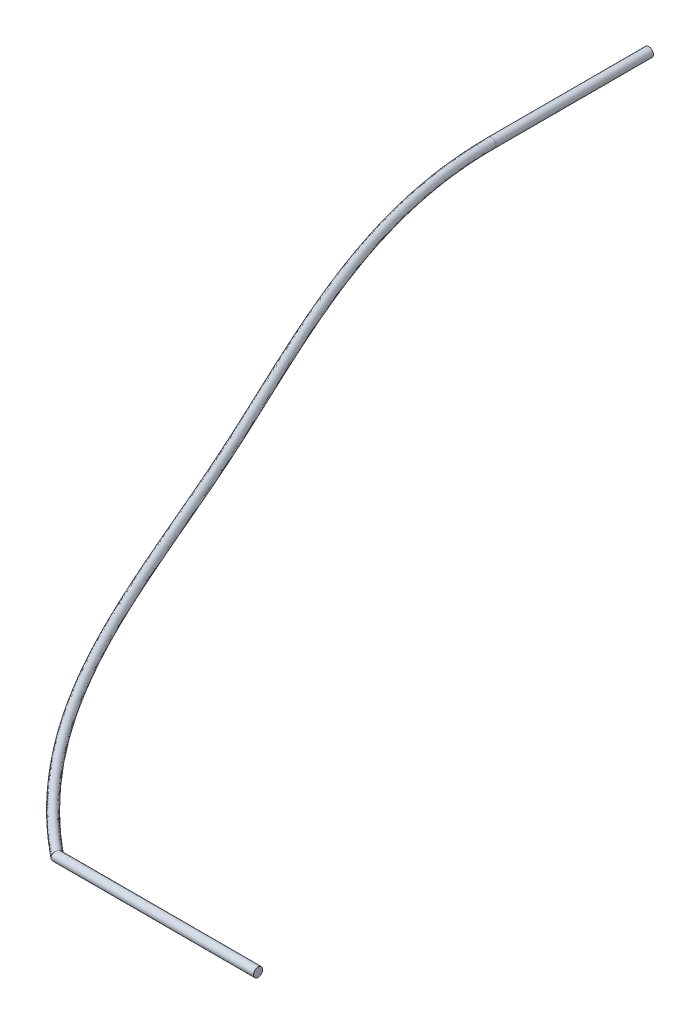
from build123d import *

# Parameters (mm, degrees)
SKETCH_2_R = 0.4


with BuildPart() as part:
    # Sweep 1: sweep along a path in Sketch 1
    with BuildLine() as sweep_1_path:  # in the path sketch's own coordinates; laid on its plane below (add() does not lay a ready-made edge on the line's plane)
        Line((0, 0), (0, -13.780162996))
        add(Edge.make_bspline(
            [(0, -13.780162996), (0, -25.395132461), (14.871690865, -51.835994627), (22.658510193, -76.803994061), (35.098600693, -86.93872727)],
            knots=[0, 0, 0, 0, 0.457950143, 1, 1, 1, 1], degree=3))
        Line((35.098600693, -86.93872727), (52.703186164, -86.93872727))
    # Sketch 2 → Sweep 1 (sweep)
    with BuildSketch(Plane.XY):
        Circle(SKETCH_2_R)
    sweep(path=Plane(origin=(0, 0, 0), x_dir=(1, 0, 0), z_dir=(0, 1, 0)) * sweep_1_path.line, transition=Transition.RIGHT)


solid = part.part
